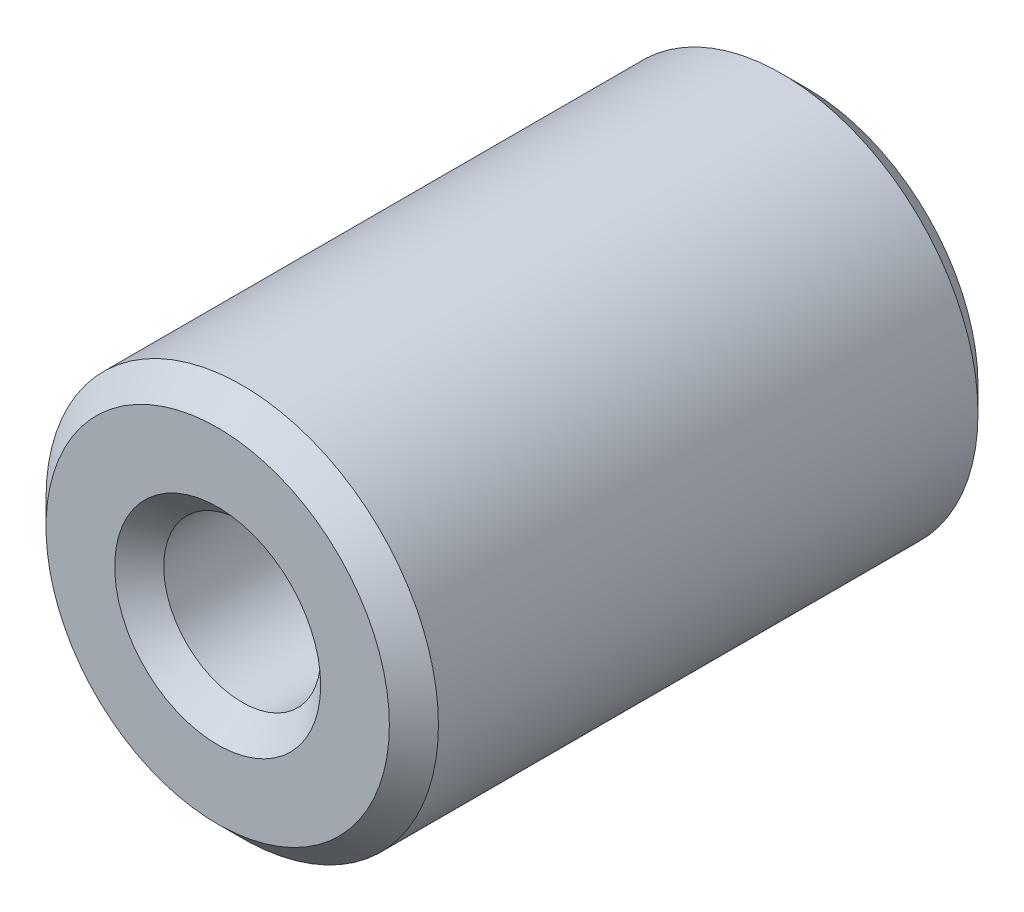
ISO-10303-21;
HEADER;
FILE_DESCRIPTION(('STEP AP214'),'2;1');
FILE_NAME('part.step','',(''),(''),'','','');
FILE_SCHEMA(('AUTOMOTIVE_DESIGN { 1 0 10303 214 1 1 1 1 }'));
ENDSEC;
DATA;
#1=APPLICATION_CONTEXT('core data for automotive mechanical design processes');
#2=APPLICATION_PROTOCOL_DEFINITION('international standard','automotive_design',2000,#1);
#3=PRODUCT_CONTEXT('',#1,'mechanical');
#4=PRODUCT('Part','Part','',(#3));
#5=PRODUCT_RELATED_PRODUCT_CATEGORY('part','',(#4));
#6=PRODUCT_DEFINITION_FORMATION('','',#4);
#7=PRODUCT_DEFINITION_CONTEXT('part definition',#1,'design');
#8=PRODUCT_DEFINITION('design','',#6,#7);
#9=PRODUCT_DEFINITION_SHAPE('','',#8);
#10=(LENGTH_UNIT() NAMED_UNIT(*) SI_UNIT(.MILLI.,.METRE.));
#11=(NAMED_UNIT(*) PLANE_ANGLE_UNIT() SI_UNIT($,.RADIAN.));
#12=(NAMED_UNIT(*) SI_UNIT($,.STERADIAN.) SOLID_ANGLE_UNIT());
#13=UNCERTAINTY_MEASURE_WITH_UNIT(LENGTH_MEASURE(1.E-05),#10,'distance_accuracy_value','');
#14=(GEOMETRIC_REPRESENTATION_CONTEXT(3) GLOBAL_UNCERTAINTY_ASSIGNED_CONTEXT((#13)) GLOBAL_UNIT_ASSIGNED_CONTEXT((#10,
#11,#12)) REPRESENTATION_CONTEXT('',''));
#15=CARTESIAN_POINT('',(0.,0.,0.));
#16=DIRECTION('',(0.,0.,1.));
#17=DIRECTION('',(1.,0.,0.));
#18=AXIS2_PLACEMENT_3D('',#15,#16,#17);
#19=CARTESIAN_POINT('',(0.,0.,6.));
#20=DIRECTION('',(0.,0.,1.));
#21=DIRECTION('',(1.,0.,0.));
#22=AXIS2_PLACEMENT_3D('',#19,#20,#21);
#23=PLANE('',#22);
#24=CARTESIAN_POINT('',(0.,0.,6.));
#25=DIRECTION('',(0.,0.,1.));
#26=DIRECTION('',(1.,0.,0.));
#27=AXIS2_PLACEMENT_3D('',#24,#25,#26);
#28=CIRCLE('',#27,1.75);
#29=CARTESIAN_POINT('',(1.75,0.,6.));
#30=VERTEX_POINT('',#29);
#31=EDGE_CURVE('E40',#30,#30,#28,.T.);
#32=ORIENTED_EDGE('',*,*,#31,.T.);
#33=EDGE_LOOP('',(#32));
#34=FACE_BOUND('',#33,.T.);
#35=CARTESIAN_POINT('',(0.,0.,6.));
#36=DIRECTION('',(0.,0.,1.));
#37=DIRECTION('',(1.,0.,0.));
#38=AXIS2_PLACEMENT_3D('',#35,#36,#37);
#39=CIRCLE('',#38,1.05);
#40=CARTESIAN_POINT('',(1.05,0.,6.));
#41=VERTEX_POINT('',#40);
#42=EDGE_CURVE('E44',#41,#41,#39,.F.);
#43=ORIENTED_EDGE('',*,*,#42,.T.);
#44=EDGE_LOOP('',(#43));
#45=FACE_BOUND('',#44,.T.);
#46=ADVANCED_FACE('F29',(#34,#45),#23,.T.);
#47=CARTESIAN_POINT('',(0.,0.,0.));
#48=DIRECTION('',(0.,0.,1.));
#49=DIRECTION('',(1.,0.,0.));
#50=AXIS2_PLACEMENT_3D('',#47,#48,#49);
#51=PLANE('',#50);
#52=CARTESIAN_POINT('',(0.,0.,0.));
#53=DIRECTION('',(0.,0.,1.));
#54=DIRECTION('',(1.,0.,0.));
#55=AXIS2_PLACEMENT_3D('',#52,#53,#54);
#56=CIRCLE('',#55,1.75);
#57=CARTESIAN_POINT('',(1.75,0.,0.));
#58=VERTEX_POINT('',#57);
#59=EDGE_CURVE('E49',#58,#58,#56,.F.);
#60=ORIENTED_EDGE('',*,*,#59,.T.);
#61=EDGE_LOOP('',(#60));
#62=FACE_BOUND('',#61,.T.);
#63=CARTESIAN_POINT('',(0.,0.,0.));
#64=DIRECTION('',(0.,0.,1.));
#65=DIRECTION('',(1.,0.,0.));
#66=AXIS2_PLACEMENT_3D('',#63,#64,#65);
#67=CIRCLE('',#66,1.05);
#68=CARTESIAN_POINT('',(1.05,0.,0.));
#69=VERTEX_POINT('',#68);
#70=EDGE_CURVE('E52',#69,#69,#67,.T.);
#71=ORIENTED_EDGE('',*,*,#70,.T.);
#72=EDGE_LOOP('',(#71));
#73=FACE_BOUND('',#72,.T.);
#74=ADVANCED_FACE('F74',(#62,#73),#51,.F.);
#75=CARTESIAN_POINT('',(0.,0.,6.));
#76=DIRECTION('',(0.,0.,-1.));
#77=DIRECTION('',(-1.,0.,0.));
#78=AXIS2_PLACEMENT_3D('',#75,#76,#77);
#79=CYLINDRICAL_SURFACE('',#78,2.);
#80=CARTESIAN_POINT('',(0.,0.,0.249999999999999));
#81=DIRECTION('',(0.,0.,1.));
#82=DIRECTION('',(1.,0.,0.));
#83=AXIS2_PLACEMENT_3D('',#80,#81,#82);
#84=CIRCLE('',#83,2.);
#85=CARTESIAN_POINT('',(2.,0.,0.249999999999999));
#86=VERTEX_POINT('',#85);
#87=EDGE_CURVE('E55',#86,#86,#84,.T.);
#88=ORIENTED_EDGE('',*,*,#87,.T.);
#89=EDGE_LOOP('',(#88));
#90=FACE_BOUND('',#89,.T.);
#91=CARTESIAN_POINT('',(0.,0.,5.75));
#92=DIRECTION('',(0.,0.,1.));
#93=DIRECTION('',(1.,0.,0.));
#94=AXIS2_PLACEMENT_3D('',#91,#92,#93);
#95=CIRCLE('',#94,2.);
#96=CARTESIAN_POINT('',(2.,0.,5.75));
#97=VERTEX_POINT('',#96);
#98=EDGE_CURVE('E58',#97,#97,#95,.F.);
#99=ORIENTED_EDGE('',*,*,#98,.T.);
#100=EDGE_LOOP('',(#99));
#101=FACE_BOUND('',#100,.T.);
#102=ADVANCED_FACE('F62',(#90,#101),#79,.T.);
#103=CARTESIAN_POINT('',(0.,0.,6.));
#104=DIRECTION('',(0.,0.,-1.));
#105=DIRECTION('',(-1.,0.,0.));
#106=AXIS2_PLACEMENT_3D('',#103,#104,#105);
#107=CYLINDRICAL_SURFACE('',#106,0.8);
#108=CARTESIAN_POINT('',(0.,0.,0.250000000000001));
#109=DIRECTION('',(0.,0.,1.));
#110=DIRECTION('',(1.,0.,0.));
#111=AXIS2_PLACEMENT_3D('',#108,#109,#110);
#112=CIRCLE('',#111,0.8);
#113=CARTESIAN_POINT('',(0.8,0.,0.250000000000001));
#114=VERTEX_POINT('',#113);
#115=EDGE_CURVE('E10',#114,#114,#112,.F.);
#116=ORIENTED_EDGE('',*,*,#115,.T.);
#117=EDGE_LOOP('',(#116));
#118=FACE_BOUND('',#117,.T.);
#119=CARTESIAN_POINT('',(0.,0.,5.75));
#120=DIRECTION('',(0.,0.,1.));
#121=DIRECTION('',(1.,0.,0.));
#122=AXIS2_PLACEMENT_3D('',#119,#120,#121);
#123=CIRCLE('',#122,0.8);
#124=CARTESIAN_POINT('',(0.8,0.,5.75));
#125=VERTEX_POINT('',#124);
#126=EDGE_CURVE('E36',#125,#125,#123,.T.);
#127=ORIENTED_EDGE('',*,*,#126,.T.);
#128=EDGE_LOOP('',(#127));
#129=FACE_BOUND('',#128,.T.);
#130=ADVANCED_FACE('F90',(#118,#129),#107,.F.);
#131=CARTESIAN_POINT('',(0.,0.,0.249999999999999));
#132=DIRECTION('',(0.,0.,1.));
#133=DIRECTION('',(1.,0.,0.));
#134=AXIS2_PLACEMENT_3D('',#131,#132,#133);
#135=CONICAL_SURFACE('',#134,2.,0.78539816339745);
#136=ORIENTED_EDGE('',*,*,#59,.F.);
#137=EDGE_LOOP('',(#136));
#138=FACE_BOUND('',#137,.T.);
#139=ORIENTED_EDGE('',*,*,#87,.F.);
#140=EDGE_LOOP('',(#139));
#141=FACE_BOUND('',#140,.T.);
#142=ADVANCED_FACE('F68',(#138,#141),#135,.T.);
#143=CARTESIAN_POINT('',(0.,0.,6.));
#144=DIRECTION('',(0.,0.,-1.));
#145=DIRECTION('',(-1.,0.,0.));
#146=AXIS2_PLACEMENT_3D('',#143,#144,#145);
#147=CONICAL_SURFACE('',#146,1.75,0.785398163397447);
#148=ORIENTED_EDGE('',*,*,#98,.F.);
#149=EDGE_LOOP('',(#148));
#150=FACE_BOUND('',#149,.T.);
#151=ORIENTED_EDGE('',*,*,#31,.F.);
#152=EDGE_LOOP('',(#151));
#153=FACE_BOUND('',#152,.T.);
#154=ADVANCED_FACE('F64',(#150,#153),#147,.T.);
#155=CARTESIAN_POINT('',(0.,0.,0.));
#156=DIRECTION('',(0.,0.,-1.));
#157=DIRECTION('',(-1.,0.,0.));
#158=AXIS2_PLACEMENT_3D('',#155,#156,#157);
#159=CONICAL_SURFACE('',#158,1.05,0.785398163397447);
#160=ORIENTED_EDGE('',*,*,#115,.F.);
#161=EDGE_LOOP('',(#160));
#162=FACE_BOUND('',#161,.T.);
#163=ORIENTED_EDGE('',*,*,#70,.F.);
#164=EDGE_LOOP('',(#163));
#165=FACE_BOUND('',#164,.T.);
#166=ADVANCED_FACE('F67',(#162,#165),#159,.F.);
#167=CARTESIAN_POINT('',(0.,0.,5.75));
#168=DIRECTION('',(0.,0.,1.));
#169=DIRECTION('',(1.,0.,0.));
#170=AXIS2_PLACEMENT_3D('',#167,#168,#169);
#171=CONICAL_SURFACE('',#170,0.8,0.785398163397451);
#172=ORIENTED_EDGE('',*,*,#42,.F.);
#173=EDGE_LOOP('',(#172));
#174=FACE_BOUND('',#173,.T.);
#175=ORIENTED_EDGE('',*,*,#126,.F.);
#176=EDGE_LOOP('',(#175));
#177=FACE_BOUND('',#176,.T.);
#178=ADVANCED_FACE('F31',(#174,#177),#171,.F.);
#179=CLOSED_SHELL('',(#46,#74,#102,#130,#142,#154,#166,#178));
#180=MANIFOLD_SOLID_BREP('B2',#179);
#181=ADVANCED_BREP_SHAPE_REPRESENTATION('',(#18,#180),#14);
#182=SHAPE_DEFINITION_REPRESENTATION(#9,#181);
ENDSEC;
END-ISO-10303-21;
